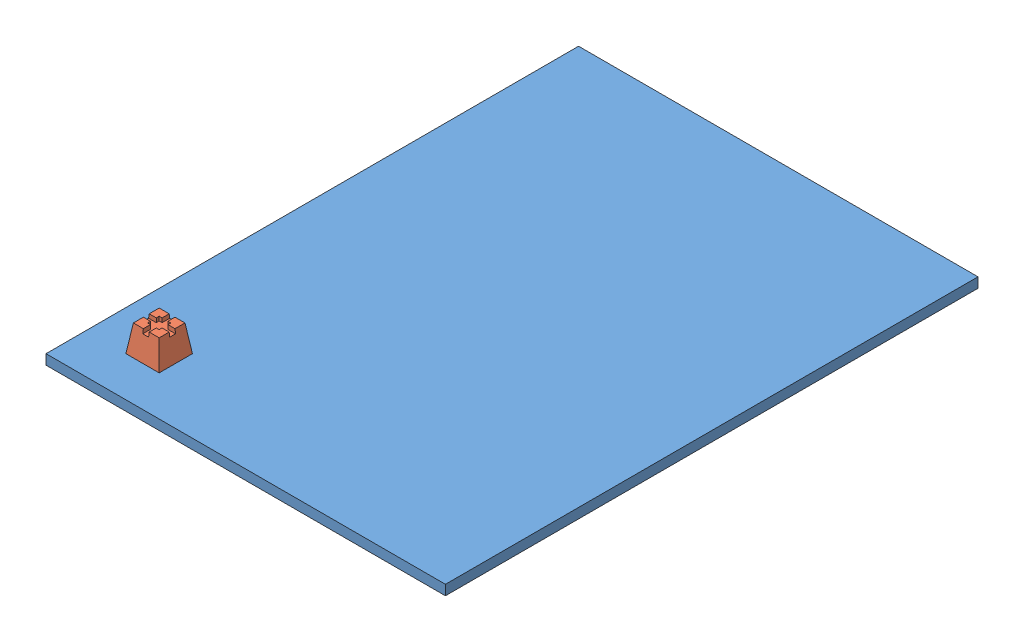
SolidWorks assembly Post Assy.SLDASM, configuration Default (file format 3400). Lengths in mm.
Overall size (3048 279.4 4064).
2 component instances, 2 part files, 3 mates.
Components (placement in the parent):
- Slab-1: Slab.SLDPRT [Default] at origin size (3048 76.2 4064)
- Post Block-1: Post Block.SLDPRT [Default] at (431.8 76.2 -431.8) size (254 203.2 254)
Mates (geometry in assembly coordinates):
- Coincident1: coincident anti-aligned: plane of Post Block-1 through (304.8 76.2 -304.8) normal (0 -1 0); plane of Slab-1 through (0 76.2 -4064) normal (0 1 0)
- Distance1: distance = 304.8 mm: line of Post Block-1; plane of Slab-1 through (0 76.2 0) normal (0 0 1)
- Distance2: distance = 304.8 mm: line of Post Block-1; plane of Slab-1 through (0 76.2 0) normal (-1 0 0)
